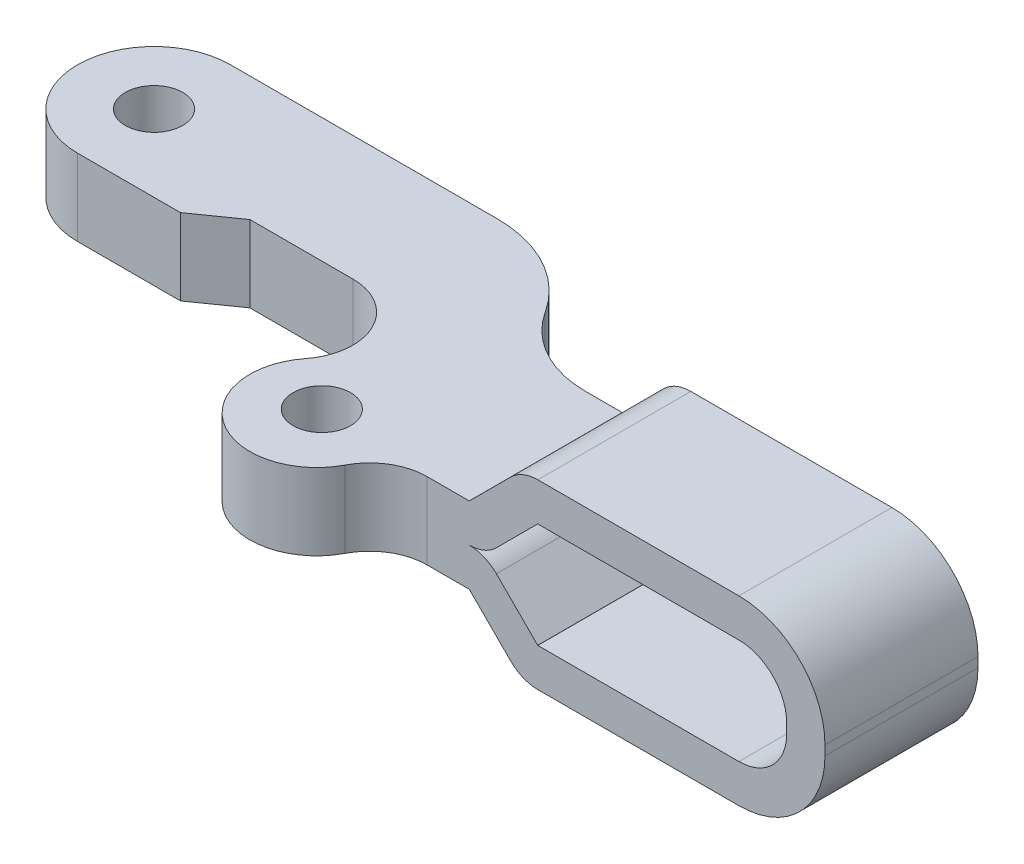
ISO-10303-21;
HEADER;
FILE_DESCRIPTION(('STEP AP214'),'2;1');
FILE_NAME('part.step','',(''),(''),'','','');
FILE_SCHEMA(('AUTOMOTIVE_DESIGN { 1 0 10303 214 1 1 1 1 }'));
ENDSEC;
DATA;
#1=APPLICATION_CONTEXT('core data for automotive mechanical design processes');
#2=APPLICATION_PROTOCOL_DEFINITION('international standard','automotive_design',2000,#1);
#3=PRODUCT_CONTEXT('',#1,'mechanical');
#4=PRODUCT('Part','Part','',(#3));
#5=PRODUCT_RELATED_PRODUCT_CATEGORY('part','',(#4));
#6=PRODUCT_DEFINITION_FORMATION('','',#4);
#7=PRODUCT_DEFINITION_CONTEXT('part definition',#1,'design');
#8=PRODUCT_DEFINITION('design','',#6,#7);
#9=PRODUCT_DEFINITION_SHAPE('','',#8);
#10=(LENGTH_UNIT() NAMED_UNIT(*) SI_UNIT(.MILLI.,.METRE.));
#11=(NAMED_UNIT(*) PLANE_ANGLE_UNIT() SI_UNIT($,.RADIAN.));
#12=(NAMED_UNIT(*) SI_UNIT($,.STERADIAN.) SOLID_ANGLE_UNIT());
#13=UNCERTAINTY_MEASURE_WITH_UNIT(LENGTH_MEASURE(1.E-05),#10,'distance_accuracy_value','');
#14=(GEOMETRIC_REPRESENTATION_CONTEXT(3) GLOBAL_UNCERTAINTY_ASSIGNED_CONTEXT((#13)) GLOBAL_UNIT_ASSIGNED_CONTEXT((#10,
#11,#12)) REPRESENTATION_CONTEXT('',''));
#15=CARTESIAN_POINT('',(0.,0.,0.));
#16=DIRECTION('',(0.,0.,1.));
#17=DIRECTION('',(1.,0.,0.));
#18=AXIS2_PLACEMENT_3D('',#15,#16,#17);
#19=CARTESIAN_POINT('',(45.7788506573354,2.,1.50570552));
#20=DIRECTION('',(0.,0.,1.));
#21=DIRECTION('',(0.,1.,0.));
#22=AXIS2_PLACEMENT_3D('',#19,#20,#21);
#23=PLANE('',#22);
#24=DIRECTION('',(0.,1.,0.));
#25=VECTOR('',#24,1.);
#26=CARTESIAN_POINT('',(44.5788506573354,1.09995593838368,1.50570552));
#27=LINE('',#26,#25);
#28=CARTESIAN_POINT('',(44.5788506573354,-0.25,1.50570552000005));
#29=VERTEX_POINT('',#28);
#30=CARTESIAN_POINT('',(44.5788506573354,0.24999999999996,1.50570552));
#31=VERTEX_POINT('',#30);
#32=EDGE_CURVE('E330',#29,#31,#27,.T.);
#33=ORIENTED_EDGE('',*,*,#32,.F.);
#34=CARTESIAN_POINT('',(40.0788506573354,-0.25000000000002,1.50570552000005));
#35=DIRECTION('',(0.,0.,-1.));
#36=DIRECTION('',(-1.,0.,0.));
#37=AXIS2_PLACEMENT_3D('',#34,#35,#36);
#38=CIRCLE('',#37,4.5);
#39=CARTESIAN_POINT('',(40.0788506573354,-4.75,1.50570552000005));
#40=VERTEX_POINT('',#39);
#41=EDGE_CURVE('E449',#40,#29,#38,.F.);
#42=ORIENTED_EDGE('',*,*,#41,.F.);
#43=DIRECTION('',(-1.,0.,0.));
#44=VECTOR('',#43,1.);
#45=CARTESIAN_POINT('',(11.8413847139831,-4.75,1.50570552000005));
#46=LINE('',#45,#44);
#47=CARTESIAN_POINT('',(29.5689359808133,-4.75,1.50570552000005));
#48=VERTEX_POINT('',#47);
#49=EDGE_CURVE('E442',#40,#48,#46,.T.);
#50=ORIENTED_EDGE('',*,*,#49,.T.);
#51=CARTESIAN_POINT('',(29.5689359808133,-2.74,1.50570552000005));
#52=DIRECTION('',(0.,0.,-1.));
#53=DIRECTION('',(-1.,0.,0.));
#54=AXIS2_PLACEMENT_3D('',#51,#52,#53);
#55=CIRCLE('',#54,2.01);
#56=CARTESIAN_POINT('',(28.1476513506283,-4.16128463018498,1.50570552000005));
#57=VERTEX_POINT('',#56);
#58=EDGE_CURVE('E438',#57,#48,#55,.F.);
#59=ORIENTED_EDGE('',*,*,#58,.F.);
#60=DIRECTION('',(-0.707106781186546,0.707106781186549,0.));
#61=VECTOR('',#60,1.);
#62=CARTESIAN_POINT('',(16.1732936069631,7.81307311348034,1.50570552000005));
#63=LINE('',#62,#61);
#64=CARTESIAN_POINT('',(25.9892956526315,-2.00292893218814,1.50570552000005));
#65=VERTEX_POINT('',#64);
#66=EDGE_CURVE('E423',#57,#65,#63,.T.);
#67=ORIENTED_EDGE('',*,*,#66,.T.);
#68=CARTESIAN_POINT('',(25.9822245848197,-2.01,1.50570552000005));
#69=DIRECTION('',(0.,0.,-1.));
#70=DIRECTION('',(0.,-1.,0.));
#71=AXIS2_PLACEMENT_3D('',#68,#69,#70);
#72=CIRCLE('',#71,0.00999999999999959);
#73=CARTESIAN_POINT('',(25.9822245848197,-2.,1.50570552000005));
#74=VERTEX_POINT('',#73);
#75=EDGE_CURVE('E445',#65,#74,#72,.F.);
#76=ORIENTED_EDGE('',*,*,#75,.T.);
#77=DIRECTION('',(-1.,0.,0.));
#78=VECTOR('',#77,1.);
#79=CARTESIAN_POINT('',(12.8935535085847,-2.,1.50570552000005));
#80=LINE('',#79,#78);
#81=CARTESIAN_POINT('',(24.0552058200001,-2.,1.50570552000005));
#82=VERTEX_POINT('',#81);
#83=EDGE_CURVE('E405',#74,#82,#80,.T.);
#84=ORIENTED_EDGE('',*,*,#83,.T.);
#85=DIRECTION('',(0.,1.,0.));
#86=VECTOR('',#85,1.);
#87=CARTESIAN_POINT('',(24.05520582,2.,1.50570552));
#88=LINE('',#87,#86);
#89=CARTESIAN_POINT('',(24.05520582,2.,1.50570552));
#90=VERTEX_POINT('',#89);
#91=EDGE_CURVE('E545',#90,#82,#88,.F.);
#92=ORIENTED_EDGE('',*,*,#91,.F.);
#93=DIRECTION('',(-1.,0.,0.));
#94=VECTOR('',#93,1.);
#95=CARTESIAN_POINT('',(45.7788506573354,2.,1.50570552));
#96=LINE('',#95,#94);
#97=CARTESIAN_POINT('',(25.9822245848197,2.,1.50570552));
#98=VERTEX_POINT('',#97);
#99=EDGE_CURVE('E27',#98,#90,#96,.T.);
#100=ORIENTED_EDGE('',*,*,#99,.F.);
#101=CARTESIAN_POINT('',(25.9822245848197,2.01,1.50570552));
#102=DIRECTION('',(0.,0.,-1.));
#103=DIRECTION('',(-1.,0.,0.));
#104=AXIS2_PLACEMENT_3D('',#101,#102,#103);
#105=CIRCLE('',#104,0.00999999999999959);
#106=CARTESIAN_POINT('',(25.9892956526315,2.0029289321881,1.50570552));
#107=VERTEX_POINT('',#106);
#108=EDGE_CURVE('E363',#107,#98,#105,.T.);
#109=ORIENTED_EDGE('',*,*,#108,.F.);
#110=DIRECTION('',(-0.707106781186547,-0.707106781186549,0.));
#111=VECTOR('',#110,1.);
#112=CARTESIAN_POINT('',(28.1476513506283,4.16128463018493,1.50570552));
#113=LINE('',#112,#111);
#114=CARTESIAN_POINT('',(28.1476513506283,4.16128463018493,1.50570552));
#115=VERTEX_POINT('',#114);
#116=EDGE_CURVE('E271',#115,#107,#113,.T.);
#117=ORIENTED_EDGE('',*,*,#116,.F.);
#118=CARTESIAN_POINT('',(29.5689359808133,2.74,1.50570552));
#119=DIRECTION('',(0.,0.,-1.));
#120=DIRECTION('',(-1.,0.,0.));
#121=AXIS2_PLACEMENT_3D('',#118,#119,#120);
#122=CIRCLE('',#121,2.01);
#123=CARTESIAN_POINT('',(29.5689359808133,4.75,1.50570552));
#124=VERTEX_POINT('',#123);
#125=EDGE_CURVE('E293',#115,#124,#122,.T.);
#126=ORIENTED_EDGE('',*,*,#125,.T.);
#127=DIRECTION('',(1.,0.,0.));
#128=VECTOR('',#127,1.);
#129=CARTESIAN_POINT('',(44.7266818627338,4.75,1.50570552));
#130=LINE('',#129,#128);
#131=CARTESIAN_POINT('',(40.0788506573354,4.75,1.50570552));
#132=VERTEX_POINT('',#131);
#133=EDGE_CURVE('E306',#132,#124,#130,.F.);
#134=ORIENTED_EDGE('',*,*,#133,.F.);
#135=CARTESIAN_POINT('',(40.0788506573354,0.24999999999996,1.50570552));
#136=DIRECTION('',(0.,0.,-1.));
#137=DIRECTION('',(-1.,0.,0.));
#138=AXIS2_PLACEMENT_3D('',#135,#136,#137);
#139=CIRCLE('',#138,4.5);
#140=EDGE_CURVE('E318',#132,#31,#139,.T.);
#141=ORIENTED_EDGE('',*,*,#140,.T.);
#142=EDGE_LOOP('',(#33,#42,#50,#59,#67,#76,#84,#92,#100,#109,#117,#126,#134,#141));
#143=FACE_BOUND('',#142,.T.);
#144=CARTESIAN_POINT('',(40.0788506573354,-0.25000000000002,1.50570552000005));
#145=DIRECTION('',(0.,0.,-1.));
#146=DIRECTION('',(-1.,0.,0.));
#147=AXIS2_PLACEMENT_3D('',#144,#145,#146);
#148=CIRCLE('',#147,2.5);
#149=CARTESIAN_POINT('',(42.5788506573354,-0.25,1.50570552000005));
#150=VERTEX_POINT('',#149);
#151=CARTESIAN_POINT('',(40.0788506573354,-2.75,1.50570552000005));
#152=VERTEX_POINT('',#151);
#153=EDGE_CURVE('E467',#150,#152,#148,.T.);
#154=ORIENTED_EDGE('',*,*,#153,.F.);
#155=DIRECTION('',(0.,1.,0.));
#156=VECTOR('',#155,1.);
#157=CARTESIAN_POINT('',(42.5788506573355,33.9852530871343,1.50570552));
#158=LINE('',#157,#156);
#159=CARTESIAN_POINT('',(42.5788506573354,0.24999999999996,1.50570552));
#160=VERTEX_POINT('',#159);
#161=EDGE_CURVE('E322',#150,#160,#158,.T.);
#162=ORIENTED_EDGE('',*,*,#161,.T.);
#163=CARTESIAN_POINT('',(40.0788506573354,0.24999999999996,1.50570552));
#164=DIRECTION('',(0.,0.,-1.));
#165=DIRECTION('',(-1.,0.,0.));
#166=AXIS2_PLACEMENT_3D('',#163,#164,#165);
#167=CIRCLE('',#166,2.5);
#168=CARTESIAN_POINT('',(40.0788506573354,2.75,1.50570552));
#169=VERTEX_POINT('',#168);
#170=EDGE_CURVE('E309',#160,#169,#167,.F.);
#171=ORIENTED_EDGE('',*,*,#170,.T.);
#172=DIRECTION('',(-1.,0.,0.));
#173=VECTOR('',#172,1.);
#174=CARTESIAN_POINT('',(11.8413847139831,2.75,1.50570552));
#175=LINE('',#174,#173);
#176=CARTESIAN_POINT('',(29.5689359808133,2.75,1.50570552));
#177=VERTEX_POINT('',#176);
#178=EDGE_CURVE('E296',#169,#177,#175,.T.);
#179=ORIENTED_EDGE('',*,*,#178,.T.);
#180=CARTESIAN_POINT('',(29.5689359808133,2.74,1.50570552));
#181=DIRECTION('',(0.,0.,-1.));
#182=DIRECTION('',(0.,-1.,0.));
#183=AXIS2_PLACEMENT_3D('',#180,#181,#182);
#184=CIRCLE('',#183,0.00999999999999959);
#185=CARTESIAN_POINT('',(29.5618649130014,2.74707106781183,1.50570552));
#186=VERTEX_POINT('',#185);
#187=EDGE_CURVE('E275',#177,#186,#184,.F.);
#188=ORIENTED_EDGE('',*,*,#187,.T.);
#189=DIRECTION('',(-0.707106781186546,-0.707106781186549,0.));
#190=VECTOR('',#189,1.);
#191=CARTESIAN_POINT('',(17.5875071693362,-9.22728667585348,1.50570552));
#192=LINE('',#191,#190);
#193=CARTESIAN_POINT('',(27.4035092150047,0.58871536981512,1.50570552));
#194=VERTEX_POINT('',#193);
#195=EDGE_CURVE('E282',#186,#194,#192,.T.);
#196=ORIENTED_EDGE('',*,*,#195,.T.);
#197=CARTESIAN_POINT('',(25.9822245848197,2.01,1.50570552));
#198=DIRECTION('',(0.,0.,-1.));
#199=DIRECTION('',(-1.,0.,0.));
#200=AXIS2_PLACEMENT_3D('',#197,#198,#199);
#201=CIRCLE('',#200,2.01);
#202=CARTESIAN_POINT('',(25.9822245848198,0.,1.50570552));
#203=VERTEX_POINT('',#202);
#204=EDGE_CURVE('E343',#203,#194,#201,.F.);
#205=ORIENTED_EDGE('',*,*,#204,.F.);
#206=CARTESIAN_POINT('',(25.9822245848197,-2.01,1.50570552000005));
#207=DIRECTION('',(0.,0.,-1.));
#208=DIRECTION('',(-1.,0.,0.));
#209=AXIS2_PLACEMENT_3D('',#206,#207,#208);
#210=CIRCLE('',#209,2.01);
#211=CARTESIAN_POINT('',(27.4035092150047,-0.588715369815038,1.50570552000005));
#212=VERTEX_POINT('',#211);
#213=EDGE_CURVE('E484',#203,#212,#210,.T.);
#214=ORIENTED_EDGE('',*,*,#213,.T.);
#215=DIRECTION('',(-0.707106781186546,0.70710678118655,0.));
#216=VECTOR('',#215,1.);
#217=CARTESIAN_POINT('',(29.5618649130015,-2.74707106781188,1.50570552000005));
#218=LINE('',#217,#216);
#219=CARTESIAN_POINT('',(29.5618649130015,-2.74707106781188,1.50570552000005));
#220=VERTEX_POINT('',#219);
#221=EDGE_CURVE('E417',#220,#212,#218,.T.);
#222=ORIENTED_EDGE('',*,*,#221,.F.);
#223=CARTESIAN_POINT('',(29.5689359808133,-2.74,1.50570552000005));
#224=DIRECTION('',(0.,0.,-1.));
#225=DIRECTION('',(-1.,0.,0.));
#226=AXIS2_PLACEMENT_3D('',#223,#224,#225);
#227=CIRCLE('',#226,0.00999999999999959);
#228=CARTESIAN_POINT('',(29.5689359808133,-2.75,1.50570552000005));
#229=VERTEX_POINT('',#228);
#230=EDGE_CURVE('E492',#229,#220,#227,.T.);
#231=ORIENTED_EDGE('',*,*,#230,.F.);
#232=DIRECTION('',(1.,0.,0.));
#233=VECTOR('',#232,1.);
#234=CARTESIAN_POINT('',(44.7266818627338,-2.75,1.50570552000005));
#235=LINE('',#234,#233);
#236=EDGE_CURVE('E450',#152,#229,#235,.F.);
#237=ORIENTED_EDGE('',*,*,#236,.F.);
#238=EDGE_LOOP('',(#154,#162,#171,#179,#188,#196,#205,#214,#222,#231,#237));
#239=FACE_BOUND('',#238,.T.);
#240=ADVANCED_FACE('F17',(#143,#239),#23,.F.);
#241=CARTESIAN_POINT('',(24.05520582,2.,-3.99429447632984));
#242=DIRECTION('',(0.,-1.,0.));
#243=DIRECTION('',(1.,0.,0.));
#244=AXIS2_PLACEMENT_3D('',#241,#242,#243);
#245=CYLINDRICAL_SURFACE('',#244,5.49999999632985);
#246=DIRECTION('',(0.,-1.,0.));
#247=VECTOR('',#246,1.);
#248=CARTESIAN_POINT('',(19.4302582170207,2.,-1.01774284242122));
#249=LINE('',#248,#247);
#250=CARTESIAN_POINT('',(19.4302582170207,2.,-1.01774284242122));
#251=VERTEX_POINT('',#250);
#252=CARTESIAN_POINT('',(19.4302582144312,-2.,-1.01774284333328));
#253=VERTEX_POINT('',#252);
#254=EDGE_CURVE('E358',#251,#253,#249,.T.);
#255=ORIENTED_EDGE('',*,*,#254,.F.);
#256=CARTESIAN_POINT('',(24.05520582,2.,-3.99429447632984));
#257=DIRECTION('',(0.,-1.,0.));
#258=DIRECTION('',(1.,0.,0.));
#259=AXIS2_PLACEMENT_3D('',#256,#257,#258);
#260=CIRCLE('',#259,5.49999999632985);
#261=EDGE_CURVE('E359',#90,#251,#260,.T.);
#262=ORIENTED_EDGE('',*,*,#261,.F.);
#263=ORIENTED_EDGE('',*,*,#91,.T.);
#264=CARTESIAN_POINT('',(24.0552058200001,-2.,-3.99429447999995));
#265=DIRECTION('',(0.,-1.,0.));
#266=DIRECTION('',(1.,0.,0.));
#267=AXIS2_PLACEMENT_3D('',#264,#265,#266);
#268=CIRCLE('',#267,5.5);
#269=EDGE_CURVE('E408',#82,#253,#268,.T.);
#270=ORIENTED_EDGE('',*,*,#269,.T.);
#271=EDGE_LOOP('',(#255,#262,#263,#270));
#272=FACE_BOUND('',#271,.T.);
#273=ADVANCED_FACE('F575',(#272),#245,.F.);
#274=CARTESIAN_POINT('',(13.9644110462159,2.,2.5));
#275=DIRECTION('',(0.,-1.,0.));
#276=DIRECTION('',(1.,0.,0.));
#277=AXIS2_PLACEMENT_3D('',#274,#275,#276);
#278=CYLINDRICAL_SURFACE('',#277,6.5);
#279=CARTESIAN_POINT('',(13.9644110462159,2.,2.5));
#280=DIRECTION('',(0.,-1.,0.));
#281=DIRECTION('',(1.,0.,0.));
#282=AXIS2_PLACEMENT_3D('',#279,#280,#281);
#283=CIRCLE('',#282,6.5);
#284=CARTESIAN_POINT('',(13.9644110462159,2.,-4.));
#285=VERTEX_POINT('',#284);
#286=EDGE_CURVE('E356',#285,#251,#283,.T.);
#287=ORIENTED_EDGE('',*,*,#286,.T.);
#288=ORIENTED_EDGE('',*,*,#254,.T.);
#289=CARTESIAN_POINT('',(13.9644110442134,-2.,2.5000000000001));
#290=DIRECTION('',(0.,-1.,0.));
#291=DIRECTION('',(1.,0.,0.));
#292=AXIS2_PLACEMENT_3D('',#289,#290,#291);
#293=CIRCLE('',#292,6.5);
#294=CARTESIAN_POINT('',(13.9644110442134,-2.,-3.99999999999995));
#295=VERTEX_POINT('',#294);
#296=EDGE_CURVE('E404',#253,#295,#293,.F.);
#297=ORIENTED_EDGE('',*,*,#296,.T.);
#298=DIRECTION('',(0.,1.,0.));
#299=VECTOR('',#298,1.);
#300=CARTESIAN_POINT('',(13.9644110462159,2.,-4.));
#301=LINE('',#300,#299);
#302=EDGE_CURVE('E270',#295,#285,#301,.T.);
#303=ORIENTED_EDGE('',*,*,#302,.T.);
#304=EDGE_LOOP('',(#287,#288,#297,#303));
#305=FACE_BOUND('',#304,.T.);
#306=ADVANCED_FACE('F567',(#305),#278,.T.);
#307=CARTESIAN_POINT('',(0.,2.,-4.));
#308=DIRECTION('',(0.,0.,1.));
#309=DIRECTION('',(1.,0.,0.));
#310=AXIS2_PLACEMENT_3D('',#307,#308,#309);
#311=PLANE('',#310);
#312=DIRECTION('',(0.,-1.,0.));
#313=VECTOR('',#312,1.);
#314=CARTESIAN_POINT('',(0.,2.,-4.));
#315=LINE('',#314,#313);
#316=CARTESIAN_POINT('',(0.,2.,-4.));
#317=VERTEX_POINT('',#316);
#318=CARTESIAN_POINT('',(0.,-2.,-3.99999999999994));
#319=VERTEX_POINT('',#318);
#320=EDGE_CURVE('E355',#317,#319,#315,.T.);
#321=ORIENTED_EDGE('',*,*,#320,.F.);
#322=DIRECTION('',(1.,0.,0.));
#323=VECTOR('',#322,1.);
#324=CARTESIAN_POINT('',(0.,2.,-4.));
#325=LINE('',#324,#323);
#326=EDGE_CURVE('E266',#285,#317,#325,.F.);
#327=ORIENTED_EDGE('',*,*,#326,.F.);
#328=ORIENTED_EDGE('',*,*,#302,.F.);
#329=DIRECTION('',(-1.,0.,0.));
#330=VECTOR('',#329,1.);
#331=CARTESIAN_POINT('',(12.8935535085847,-2.,-3.99999999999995));
#332=LINE('',#331,#330);
#333=EDGE_CURVE('E401',#295,#319,#332,.T.);
#334=ORIENTED_EDGE('',*,*,#333,.T.);
#335=EDGE_LOOP('',(#321,#327,#328,#334));
#336=FACE_BOUND('',#335,.T.);
#337=ADVANCED_FACE('F584',(#336),#311,.F.);
#338=CARTESIAN_POINT('',(0.,2.,0.));
#339=DIRECTION('',(0.,-1.,0.));
#340=DIRECTION('',(1.,0.,0.));
#341=AXIS2_PLACEMENT_3D('',#338,#339,#340);
#342=CYLINDRICAL_SURFACE('',#341,4.);
#343=CARTESIAN_POINT('',(0.,2.,0.));
#344=DIRECTION('',(0.,-1.,0.));
#345=DIRECTION('',(1.,0.,0.));
#346=AXIS2_PLACEMENT_3D('',#343,#344,#345);
#347=CIRCLE('',#346,4.);
#348=CARTESIAN_POINT('',(0.,2.,4.));
#349=VERTEX_POINT('',#348);
#350=EDGE_CURVE('E269',#349,#317,#347,.T.);
#351=ORIENTED_EDGE('',*,*,#350,.T.);
#352=ORIENTED_EDGE('',*,*,#320,.T.);
#353=CARTESIAN_POINT('',(0.,-2.,0.));
#354=DIRECTION('',(0.,-1.,0.));
#355=DIRECTION('',(1.,0.,0.));
#356=AXIS2_PLACEMENT_3D('',#353,#354,#355);
#357=CIRCLE('',#356,4.);
#358=CARTESIAN_POINT('',(0.,-2.,4.00000000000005));
#359=VERTEX_POINT('',#358);
#360=EDGE_CURVE('E400',#319,#359,#357,.F.);
#361=ORIENTED_EDGE('',*,*,#360,.T.);
#362=DIRECTION('',(0.,1.,0.));
#363=VECTOR('',#362,1.);
#364=CARTESIAN_POINT('',(0.,2.,4.));
#365=LINE('',#364,#363);
#366=EDGE_CURVE('E265',#359,#349,#365,.T.);
#367=ORIENTED_EDGE('',*,*,#366,.T.);
#368=EDGE_LOOP('',(#351,#352,#361,#367));
#369=FACE_BOUND('',#368,.T.);
#370=ADVANCED_FACE('F876',(#369),#342,.T.);
#371=CARTESIAN_POINT('',(12.8935535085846,2.,2.5));
#372=DIRECTION('',(0.,0.,-1.));
#373=DIRECTION('',(-1.,0.,0.));
#374=AXIS2_PLACEMENT_3D('',#371,#372,#373);
#375=PLANE('',#374);
#376=DIRECTION('',(0.,-1.,0.));
#377=VECTOR('',#376,1.);
#378=CARTESIAN_POINT('',(12.8935535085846,2.,2.5));
#379=LINE('',#378,#377);
#380=CARTESIAN_POINT('',(12.8935535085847,-2.,2.50000000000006));
#381=VERTEX_POINT('',#380);
#382=CARTESIAN_POINT('',(12.8935535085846,2.,2.5));
#383=VERTEX_POINT('',#382);
#384=EDGE_CURVE('E256',#381,#383,#379,.F.);
#385=ORIENTED_EDGE('',*,*,#384,.T.);
#386=DIRECTION('',(-1.,0.,0.));
#387=VECTOR('',#386,1.);
#388=CARTESIAN_POINT('',(12.8935535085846,2.,2.5));
#389=LINE('',#388,#387);
#390=CARTESIAN_POINT('',(7.51152342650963,2.,2.5));
#391=VERTEX_POINT('',#390);
#392=EDGE_CURVE('E243',#391,#383,#389,.F.);
#393=ORIENTED_EDGE('',*,*,#392,.F.);
#394=DIRECTION('',(0.,-1.,0.));
#395=VECTOR('',#394,1.);
#396=CARTESIAN_POINT('',(7.51152342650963,2.,2.5));
#397=LINE('',#396,#395);
#398=CARTESIAN_POINT('',(7.51152342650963,-2.,2.5));
#399=VERTEX_POINT('',#398);
#400=EDGE_CURVE('E247',#391,#399,#397,.T.);
#401=ORIENTED_EDGE('',*,*,#400,.T.);
#402=DIRECTION('',(-1.,0.,0.));
#403=VECTOR('',#402,1.);
#404=CARTESIAN_POINT('',(12.8935535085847,-2.,2.50000000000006));
#405=LINE('',#404,#403);
#406=EDGE_CURVE('E393',#399,#381,#405,.F.);
#407=ORIENTED_EDGE('',*,*,#406,.T.);
#408=EDGE_LOOP('',(#385,#393,#401,#407));
#409=FACE_BOUND('',#408,.T.);
#410=ADVANCED_FACE('F255',(#409),#375,.F.);
#411=CARTESIAN_POINT('',(12.8935535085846,2.,5.5));
#412=DIRECTION('',(0.,-1.,0.));
#413=DIRECTION('',(1.,0.,0.));
#414=AXIS2_PLACEMENT_3D('',#411,#412,#413);
#415=CYLINDRICAL_SURFACE('',#414,3.);
#416=CARTESIAN_POINT('',(12.8935535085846,2.,5.5));
#417=DIRECTION('',(0.,-1.,0.));
#418=DIRECTION('',(1.,0.,0.));
#419=AXIS2_PLACEMENT_3D('',#416,#417,#418);
#420=CIRCLE('',#419,3.);
#421=CARTESIAN_POINT('',(15.2561762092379,2.,7.34878716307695));
#422=VERTEX_POINT('',#421);
#423=EDGE_CURVE('E258',#383,#422,#420,.T.);
#424=ORIENTED_EDGE('',*,*,#423,.F.);
#425=ORIENTED_EDGE('',*,*,#384,.F.);
#426=CARTESIAN_POINT('',(12.8935535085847,-2.,5.5));
#427=DIRECTION('',(0.,-1.,0.));
#428=DIRECTION('',(1.,0.,0.));
#429=AXIS2_PLACEMENT_3D('',#426,#427,#428);
#430=CIRCLE('',#429,3.);
#431=CARTESIAN_POINT('',(15.256176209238,-2.,7.348787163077));
#432=VERTEX_POINT('',#431);
#433=EDGE_CURVE('E395',#381,#432,#430,.T.);
#434=ORIENTED_EDGE('',*,*,#433,.T.);
#435=DIRECTION('',(0.,-1.,0.));
#436=VECTOR('',#435,1.);
#437=CARTESIAN_POINT('',(15.2561762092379,2.,7.34878716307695));
#438=LINE('',#437,#436);
#439=EDGE_CURVE('E352',#422,#432,#438,.T.);
#440=ORIENTED_EDGE('',*,*,#439,.F.);
#441=EDGE_LOOP('',(#424,#425,#434,#440));
#442=FACE_BOUND('',#441,.T.);
#443=ADVANCED_FACE('F857',(#442),#415,.F.);
#444=CARTESIAN_POINT('',(18.01256936,2.,9.50570552));
#445=DIRECTION('',(0.,-1.,0.));
#446=DIRECTION('',(1.,0.,0.));
#447=AXIS2_PLACEMENT_3D('',#444,#445,#446);
#448=CYLINDRICAL_SURFACE('',#447,3.5);
#449=CARTESIAN_POINT('',(18.01256936,2.,9.50570552));
#450=DIRECTION('',(0.,-1.,0.));
#451=DIRECTION('',(1.,0.,0.));
#452=AXIS2_PLACEMENT_3D('',#449,#450,#451);
#453=CIRCLE('',#452,3.5);
#454=CARTESIAN_POINT('',(21.1174900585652,2.,11.1210901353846));
#455=VERTEX_POINT('',#454);
#456=EDGE_CURVE('E350',#455,#422,#453,.T.);
#457=ORIENTED_EDGE('',*,*,#456,.T.);
#458=ORIENTED_EDGE('',*,*,#439,.T.);
#459=CARTESIAN_POINT('',(18.0125693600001,-2.,9.50570552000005));
#460=DIRECTION('',(0.,-1.,0.));
#461=DIRECTION('',(1.,0.,0.));
#462=AXIS2_PLACEMENT_3D('',#459,#460,#461);
#463=CIRCLE('',#462,3.5);
#464=CARTESIAN_POINT('',(21.1174900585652,-2.,11.1210901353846));
#465=VERTEX_POINT('',#464);
#466=EDGE_CURVE('E472',#432,#465,#463,.F.);
#467=ORIENTED_EDGE('',*,*,#466,.T.);
#468=DIRECTION('',(0.,-1.,0.));
#469=VECTOR('',#468,1.);
#470=CARTESIAN_POINT('',(21.1174900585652,2.,11.1210901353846));
#471=LINE('',#470,#469);
#472=EDGE_CURVE('E349',#465,#455,#471,.F.);
#473=ORIENTED_EDGE('',*,*,#472,.T.);
#474=EDGE_LOOP('',(#457,#458,#467,#473));
#475=FACE_BOUND('',#474,.T.);
#476=ADVANCED_FACE('F848',(#475),#448,.T.);
#477=CARTESIAN_POINT('',(40.0788506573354,0.24999999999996,15.4165916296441));
#478=DIRECTION('',(0.,0.,-1.));
#479=DIRECTION('',(-1.,0.,0.));
#480=AXIS2_PLACEMENT_3D('',#477,#478,#479);
#481=CYLINDRICAL_SURFACE('',#480,2.5);
#482=DIRECTION('',(0.,0.,-1.));
#483=VECTOR('',#482,1.);
#484=CARTESIAN_POINT('',(42.5788506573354,0.249999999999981,15.4165916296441));
#485=LINE('',#484,#483);
#486=CARTESIAN_POINT('',(42.5788506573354,0.249999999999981,9.50570552));
#487=VERTEX_POINT('',#486);
#488=EDGE_CURVE('E319',#487,#160,#485,.T.);
#489=ORIENTED_EDGE('',*,*,#488,.F.);
#490=CARTESIAN_POINT('',(40.0788506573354,0.24999999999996,9.50570552));
#491=DIRECTION('',(0.,0.,-1.));
#492=DIRECTION('',(-1.,0.,0.));
#493=AXIS2_PLACEMENT_3D('',#490,#491,#492);
#494=CIRCLE('',#493,2.5);
#495=CARTESIAN_POINT('',(40.0788506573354,2.75,9.50570552));
#496=VERTEX_POINT('',#495);
#497=EDGE_CURVE('E315',#496,#487,#494,.T.);
#498=ORIENTED_EDGE('',*,*,#497,.F.);
#499=DIRECTION('',(0.,0.,1.));
#500=VECTOR('',#499,1.);
#501=CARTESIAN_POINT('',(40.0788506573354,2.75,5.5));
#502=LINE('',#501,#500);
#503=EDGE_CURVE('E302',#496,#169,#502,.F.);
#504=ORIENTED_EDGE('',*,*,#503,.T.);
#505=ORIENTED_EDGE('',*,*,#170,.F.);
#506=EDGE_LOOP('',(#489,#498,#504,#505));
#507=FACE_BOUND('',#506,.T.);
#508=ADVANCED_FACE('F524',(#507),#481,.F.);
#509=CARTESIAN_POINT('',(11.8413847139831,2.75,5.5));
#510=DIRECTION('',(0.,1.,0.));
#511=DIRECTION('',(-1.,0.,0.));
#512=AXIS2_PLACEMENT_3D('',#509,#510,#511);
#513=PLANE('',#512);
#514=DIRECTION('',(-1.,0.,0.));
#515=VECTOR('',#514,1.);
#516=CARTESIAN_POINT('',(11.8413847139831,2.75,9.50570552));
#517=LINE('',#516,#515);
#518=CARTESIAN_POINT('',(29.5689359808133,2.75,9.50570552));
#519=VERTEX_POINT('',#518);
#520=EDGE_CURVE('E298',#519,#496,#517,.F.);
#521=ORIENTED_EDGE('',*,*,#520,.F.);
#522=DIRECTION('',(0.,0.,-1.));
#523=VECTOR('',#522,1.);
#524=CARTESIAN_POINT('',(29.5689359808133,2.75,13.979326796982));
#525=LINE('',#524,#523);
#526=EDGE_CURVE('E290',#519,#177,#525,.T.);
#527=ORIENTED_EDGE('',*,*,#526,.T.);
#528=ORIENTED_EDGE('',*,*,#178,.F.);
#529=ORIENTED_EDGE('',*,*,#503,.F.);
#530=EDGE_LOOP('',(#521,#527,#528,#529));
#531=FACE_BOUND('',#530,.T.);
#532=ADVANCED_FACE('F535',(#531),#513,.F.);
#533=CARTESIAN_POINT('',(29.5689359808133,2.74,13.979326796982));
#534=DIRECTION('',(0.,0.,-1.));
#535=DIRECTION('',(-1.,0.,0.));
#536=AXIS2_PLACEMENT_3D('',#533,#534,#535);
#537=CYLINDRICAL_SURFACE('',#536,0.00999999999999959);
#538=ORIENTED_EDGE('',*,*,#187,.F.);
#539=ORIENTED_EDGE('',*,*,#526,.F.);
#540=CARTESIAN_POINT('',(29.5689359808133,2.74,9.50570552));
#541=DIRECTION('',(0.,0.,1.));
#542=DIRECTION('',(0.,1.,0.));
#543=AXIS2_PLACEMENT_3D('',#540,#541,#542);
#544=CIRCLE('',#543,0.00999999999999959);
#545=CARTESIAN_POINT('',(29.5618649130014,2.74707106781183,9.50570552));
#546=VERTEX_POINT('',#545);
#547=EDGE_CURVE('E305',#546,#519,#544,.F.);
#548=ORIENTED_EDGE('',*,*,#547,.F.);
#549=DIRECTION('',(0.,0.,1.));
#550=VECTOR('',#549,1.);
#551=CARTESIAN_POINT('',(29.5618649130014,2.74707106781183,5.5));
#552=LINE('',#551,#550);
#553=EDGE_CURVE('E279',#546,#186,#552,.F.);
#554=ORIENTED_EDGE('',*,*,#553,.T.);
#555=EDGE_LOOP('',(#538,#539,#548,#554));
#556=FACE_BOUND('',#555,.T.);
#557=ADVANCED_FACE('F532',(#556),#537,.F.);
#558=CARTESIAN_POINT('',(17.5875071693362,-9.22728667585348,5.5));
#559=DIRECTION('',(-0.707106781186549,0.707106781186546,0.));
#560=DIRECTION('',(-0.707106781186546,-0.707106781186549,0.));
#561=AXIS2_PLACEMENT_3D('',#558,#559,#560);
#562=PLANE('',#561);
#563=ORIENTED_EDGE('',*,*,#553,.F.);
#564=DIRECTION('',(-0.707106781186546,-0.707106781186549,0.));
#565=VECTOR('',#564,1.);
#566=CARTESIAN_POINT('',(17.5875071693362,-9.22728667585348,9.50570552));
#567=LINE('',#566,#565);
#568=CARTESIAN_POINT('',(27.4035092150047,0.58871536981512,9.50570552));
#569=VERTEX_POINT('',#568);
#570=EDGE_CURVE('E283',#569,#546,#567,.F.);
#571=ORIENTED_EDGE('',*,*,#570,.F.);
#572=DIRECTION('',(0.,0.,-1.));
#573=VECTOR('',#572,1.);
#574=CARTESIAN_POINT('',(27.4035092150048,0.58871536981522,13.7899827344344));
#575=LINE('',#574,#573);
#576=EDGE_CURVE('E345',#194,#569,#575,.F.);
#577=ORIENTED_EDGE('',*,*,#576,.F.);
#578=ORIENTED_EDGE('',*,*,#195,.F.);
#579=EDGE_LOOP('',(#563,#571,#577,#578));
#580=FACE_BOUND('',#579,.T.);
#581=ADVANCED_FACE('F538',(#580),#562,.F.);
#582=CARTESIAN_POINT('',(25.9822245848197,2.01,13.7899827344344));
#583=DIRECTION('',(0.,0.,-1.));
#584=DIRECTION('',(-1.,0.,0.));
#585=AXIS2_PLACEMENT_3D('',#582,#583,#584);
#586=CYLINDRICAL_SURFACE('',#585,2.01);
#587=ORIENTED_EDGE('',*,*,#576,.T.);
#588=CARTESIAN_POINT('',(25.9822245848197,2.01,9.50570552));
#589=DIRECTION('',(0.,0.,-1.));
#590=DIRECTION('',(-1.,0.,0.));
#591=AXIS2_PLACEMENT_3D('',#588,#589,#590);
#592=CIRCLE('',#591,2.01);
#593=CARTESIAN_POINT('',(25.9822245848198,0.,9.50570552));
#594=VERTEX_POINT('',#593);
#595=EDGE_CURVE('E286',#569,#594,#592,.T.);
#596=ORIENTED_EDGE('',*,*,#595,.T.);
#597=DIRECTION('',(0.,0.,1.));
#598=VECTOR('',#597,1.);
#599=CARTESIAN_POINT('',(25.98222458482,0.,5.5));
#600=LINE('',#599,#598);
#601=EDGE_CURVE('E11',#594,#203,#600,.F.);
#602=ORIENTED_EDGE('',*,*,#601,.T.);
#603=ORIENTED_EDGE('',*,*,#204,.T.);
#604=EDGE_LOOP('',(#587,#596,#602,#603));
#605=FACE_BOUND('',#604,.T.);
#606=ADVANCED_FACE('F806',(#605),#586,.T.);
#607=CARTESIAN_POINT('',(23.7788506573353,2.,12.5057055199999));
#608=DIRECTION('',(0.,-1.,0.));
#609=DIRECTION('',(1.,0.,0.));
#610=AXIS2_PLACEMENT_3D('',#607,#608,#609);
#611=CYLINDRICAL_SURFACE('',#610,2.99999999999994);
#612=DIRECTION('',(0.,1.,0.));
#613=VECTOR('',#612,1.);
#614=CARTESIAN_POINT('',(23.7788506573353,2.,9.50570552));
#615=LINE('',#614,#613);
#616=CARTESIAN_POINT('',(23.7788506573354,-2.,9.50570552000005));
#617=VERTEX_POINT('',#616);
#618=CARTESIAN_POINT('',(23.7788506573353,2.,9.50570552));
#619=VERTEX_POINT('',#618);
#620=EDGE_CURVE('E348',#617,#619,#615,.T.);
#621=ORIENTED_EDGE('',*,*,#620,.T.);
#622=CARTESIAN_POINT('',(23.7788506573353,2.,12.5057055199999));
#623=DIRECTION('',(0.,-1.,0.));
#624=DIRECTION('',(1.,0.,0.));
#625=AXIS2_PLACEMENT_3D('',#622,#623,#624);
#626=CIRCLE('',#625,2.99999999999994);
#627=EDGE_CURVE('E346',#455,#619,#626,.T.);
#628=ORIENTED_EDGE('',*,*,#627,.F.);
#629=ORIENTED_EDGE('',*,*,#472,.F.);
#630=CARTESIAN_POINT('',(23.7788506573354,-2.,12.50570552));
#631=DIRECTION('',(0.,-1.,0.));
#632=DIRECTION('',(1.,0.,0.));
#633=AXIS2_PLACEMENT_3D('',#630,#631,#632);
#634=CIRCLE('',#633,2.99999999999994);
#635=EDGE_CURVE('E392',#465,#617,#634,.T.);
#636=ORIENTED_EDGE('',*,*,#635,.T.);
#637=EDGE_LOOP('',(#621,#628,#629,#636));
#638=FACE_BOUND('',#637,.T.);
#639=ADVANCED_FACE('F798',(#638),#611,.F.);
#640=CARTESIAN_POINT('',(12.8935535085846,2.,5.5));
#641=DIRECTION('',(0.,1.,0.));
#642=DIRECTION('',(-1.,0.,0.));
#643=AXIS2_PLACEMENT_3D('',#640,#641,#642);
#644=PLANE('',#643);
#645=ORIENTED_EDGE('',*,*,#627,.T.);
#646=DIRECTION('',(-1.,0.,0.));
#647=VECTOR('',#646,1.);
#648=CARTESIAN_POINT('',(45.7788506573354,2.,9.50570552));
#649=LINE('',#648,#647);
#650=CARTESIAN_POINT('',(25.9822245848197,2.,9.50570552));
#651=VERTEX_POINT('',#650);
#652=EDGE_CURVE('E261',#619,#651,#649,.F.);
#653=ORIENTED_EDGE('',*,*,#652,.T.);
#654=DIRECTION('',(0.,0.,1.));
#655=VECTOR('',#654,1.);
#656=CARTESIAN_POINT('',(25.9822245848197,2.,5.5));
#657=LINE('',#656,#655);
#658=EDGE_CURVE('E362',#651,#98,#657,.F.);
#659=ORIENTED_EDGE('',*,*,#658,.T.);
#660=ORIENTED_EDGE('',*,*,#99,.T.);
#661=ORIENTED_EDGE('',*,*,#261,.T.);
#662=ORIENTED_EDGE('',*,*,#286,.F.);
#663=ORIENTED_EDGE('',*,*,#326,.T.);
#664=ORIENTED_EDGE('',*,*,#350,.F.);
#665=DIRECTION('',(-1.,0.,0.));
#666=VECTOR('',#665,1.);
#667=CARTESIAN_POINT('',(0.,2.,4.));
#668=LINE('',#667,#666);
#669=CARTESIAN_POINT('',(5.38307145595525,2.,4.));
#670=VERTEX_POINT('',#669);
#671=EDGE_CURVE('E233',#349,#670,#668,.F.);
#672=ORIENTED_EDGE('',*,*,#671,.T.);
#673=DIRECTION('',(-0.817408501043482,0.,0.576058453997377));
#674=VECTOR('',#673,1.);
#675=CARTESIAN_POINT('',(7.2524319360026,2.,2.68259149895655));
#676=LINE('',#675,#674);
#677=EDGE_CURVE('E237',#670,#391,#676,.F.);
#678=ORIENTED_EDGE('',*,*,#677,.T.);
#679=ORIENTED_EDGE('',*,*,#392,.T.);
#680=ORIENTED_EDGE('',*,*,#423,.T.);
#681=ORIENTED_EDGE('',*,*,#456,.F.);
#682=EDGE_LOOP('',(#645,#653,#659,#660,#661,#662,#663,#664,#672,#678,#679,#680,#681));
#683=FACE_BOUND('',#682,.T.);
#684=CARTESIAN_POINT('',(17.97670042,2.,9.20421764));
#685=DIRECTION('',(0.,1.,0.));
#686=DIRECTION('',(-1.,0.,0.));
#687=AXIS2_PLACEMENT_3D('',#684,#685,#686);
#688=CIRCLE('',#687,1.5);
#689=CARTESIAN_POINT('',(16.47670042,2.,9.20421764));
#690=VERTEX_POINT('',#689);
#691=EDGE_CURVE('E337',#690,#690,#688,.T.);
#692=ORIENTED_EDGE('',*,*,#691,.F.);
#693=EDGE_LOOP('',(#692));
#694=FACE_BOUND('',#693,.T.);
#695=CARTESIAN_POINT('',(0.,2.,0.));
#696=DIRECTION('',(0.,1.,0.));
#697=DIRECTION('',(-1.,0.,0.));
#698=AXIS2_PLACEMENT_3D('',#695,#696,#697);
#699=CIRCLE('',#698,1.5);
#700=CARTESIAN_POINT('',(-1.5,2.,0.));
#701=VERTEX_POINT('',#700);
#702=EDGE_CURVE('E412',#701,#701,#699,.T.);
#703=ORIENTED_EDGE('',*,*,#702,.F.);
#704=EDGE_LOOP('',(#703));
#705=FACE_BOUND('',#704,.T.);
#706=ADVANCED_FACE('F239',(#683,#694,#705),#644,.T.);
#707=CARTESIAN_POINT('',(0.,2.,0.));
#708=DIRECTION('',(0.,1.,0.));
#709=DIRECTION('',(-1.,0.,0.));
#710=AXIS2_PLACEMENT_3D('',#707,#708,#709);
#711=CYLINDRICAL_SURFACE('',#710,1.5);
#712=ORIENTED_EDGE('',*,*,#702,.T.);
#713=EDGE_LOOP('',(#712));
#714=FACE_BOUND('',#713,.T.);
#715=CARTESIAN_POINT('',(0.,-2.,0.));
#716=DIRECTION('',(0.,-1.,0.));
#717=DIRECTION('',(1.,0.,0.));
#718=AXIS2_PLACEMENT_3D('',#715,#716,#717);
#719=CIRCLE('',#718,1.50000000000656);
#720=CARTESIAN_POINT('',(1.50000000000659,-2.,0.));
#721=VERTEX_POINT('',#720);
#722=EDGE_CURVE('E381',#721,#721,#719,.T.);
#723=ORIENTED_EDGE('',*,*,#722,.T.);
#724=EDGE_LOOP('',(#723));
#725=FACE_BOUND('',#724,.T.);
#726=ADVANCED_FACE('F779',(#714,#725),#711,.F.);
#727=CARTESIAN_POINT('',(17.97670042,2.,9.20421764));
#728=DIRECTION('',(0.,1.,0.));
#729=DIRECTION('',(-1.,0.,0.));
#730=AXIS2_PLACEMENT_3D('',#727,#728,#729);
#731=CYLINDRICAL_SURFACE('',#730,1.5);
#732=ORIENTED_EDGE('',*,*,#691,.T.);
#733=EDGE_LOOP('',(#732));
#734=FACE_BOUND('',#733,.T.);
#735=CARTESIAN_POINT('',(17.97670042,-2.,9.20421764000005));
#736=DIRECTION('',(0.,-1.,0.));
#737=DIRECTION('',(1.,0.,0.));
#738=AXIS2_PLACEMENT_3D('',#735,#736,#737);
#739=CIRCLE('',#738,1.5000000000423);
#740=CARTESIAN_POINT('',(19.4767004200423,-2.,9.20421764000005));
#741=VERTEX_POINT('',#740);
#742=EDGE_CURVE('E384',#741,#741,#739,.T.);
#743=ORIENTED_EDGE('',*,*,#742,.T.);
#744=EDGE_LOOP('',(#743));
#745=FACE_BOUND('',#744,.T.);
#746=ADVANCED_FACE('F769',(#734,#745),#731,.F.);
#747=CARTESIAN_POINT('',(25.9822245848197,2.01,13.7899827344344));
#748=DIRECTION('',(0.,0.,-1.));
#749=DIRECTION('',(-1.,0.,0.));
#750=AXIS2_PLACEMENT_3D('',#747,#748,#749);
#751=CYLINDRICAL_SURFACE('',#750,0.00999999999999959);
#752=CARTESIAN_POINT('',(25.9822245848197,2.01,9.50570552));
#753=DIRECTION('',(0.,0.,-1.));
#754=DIRECTION('',(-1.,0.,0.));
#755=AXIS2_PLACEMENT_3D('',#752,#753,#754);
#756=CIRCLE('',#755,0.00999999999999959);
#757=CARTESIAN_POINT('',(25.9892956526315,2.0029289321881,9.50570552));
#758=VERTEX_POINT('',#757);
#759=EDGE_CURVE('E278',#651,#758,#756,.F.);
#760=ORIENTED_EDGE('',*,*,#759,.T.);
#761=DIRECTION('',(0.,0.,-1.));
#762=VECTOR('',#761,1.);
#763=CARTESIAN_POINT('',(25.9892956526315,2.0029289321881,13.7899827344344));
#764=LINE('',#763,#762);
#765=EDGE_CURVE('E274',#107,#758,#764,.F.);
#766=ORIENTED_EDGE('',*,*,#765,.F.);
#767=ORIENTED_EDGE('',*,*,#108,.T.);
#768=ORIENTED_EDGE('',*,*,#658,.F.);
#769=EDGE_LOOP('',(#760,#766,#767,#768));
#770=FACE_BOUND('',#769,.T.);
#771=ADVANCED_FACE('F759',(#770),#751,.F.);
#772=CARTESIAN_POINT('',(16.173293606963,-7.81307311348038,5.5));
#773=DIRECTION('',(-0.707106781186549,0.707106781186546,0.));
#774=DIRECTION('',(-0.707106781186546,-0.707106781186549,0.));
#775=AXIS2_PLACEMENT_3D('',#772,#773,#774);
#776=PLANE('',#775);
#777=ORIENTED_EDGE('',*,*,#765,.T.);
#778=DIRECTION('',(0.707106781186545,0.707106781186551,0.));
#779=VECTOR('',#778,1.);
#780=CARTESIAN_POINT('',(25.9892956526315,2.0029289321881,9.50570552));
#781=LINE('',#780,#779);
#782=CARTESIAN_POINT('',(28.1476513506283,4.16128463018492,9.50570552));
#783=VERTEX_POINT('',#782);
#784=EDGE_CURVE('E287',#758,#783,#781,.T.);
#785=ORIENTED_EDGE('',*,*,#784,.T.);
#786=DIRECTION('',(0.,0.,1.));
#787=VECTOR('',#786,1.);
#788=CARTESIAN_POINT('',(28.1476513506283,4.16128463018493,5.5));
#789=LINE('',#788,#787);
#790=EDGE_CURVE('E291',#783,#115,#789,.F.);
#791=ORIENTED_EDGE('',*,*,#790,.T.);
#792=ORIENTED_EDGE('',*,*,#116,.T.);
#793=EDGE_LOOP('',(#777,#785,#791,#792));
#794=FACE_BOUND('',#793,.T.);
#795=ADVANCED_FACE('F749',(#794),#776,.T.);
#796=CARTESIAN_POINT('',(29.5689359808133,2.74,13.979326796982));
#797=DIRECTION('',(0.,0.,-1.));
#798=DIRECTION('',(-1.,0.,0.));
#799=AXIS2_PLACEMENT_3D('',#796,#797,#798);
#800=CYLINDRICAL_SURFACE('',#799,2.01);
#801=DIRECTION('',(0.,0.,-1.));
#802=VECTOR('',#801,1.);
#803=CARTESIAN_POINT('',(29.5689359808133,4.75,13.979326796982));
#804=LINE('',#803,#802);
#805=CARTESIAN_POINT('',(29.5689359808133,4.75,9.50570552));
#806=VERTEX_POINT('',#805);
#807=EDGE_CURVE('E303',#806,#124,#804,.T.);
#808=ORIENTED_EDGE('',*,*,#807,.T.);
#809=ORIENTED_EDGE('',*,*,#125,.F.);
#810=ORIENTED_EDGE('',*,*,#790,.F.);
#811=CARTESIAN_POINT('',(29.5689359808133,2.74,9.50570552));
#812=DIRECTION('',(0.,0.,-1.));
#813=DIRECTION('',(-1.,0.,0.));
#814=AXIS2_PLACEMENT_3D('',#811,#812,#813);
#815=CIRCLE('',#814,2.01);
#816=EDGE_CURVE('E299',#806,#783,#815,.F.);
#817=ORIENTED_EDGE('',*,*,#816,.F.);
#818=EDGE_LOOP('',(#808,#809,#810,#817));
#819=FACE_BOUND('',#818,.T.);
#820=ADVANCED_FACE('F739',(#819),#800,.T.);
#821=CARTESIAN_POINT('',(11.8413847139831,4.75,5.5));
#822=DIRECTION('',(0.,1.,0.));
#823=DIRECTION('',(-1.,0.,0.));
#824=AXIS2_PLACEMENT_3D('',#821,#822,#823);
#825=PLANE('',#824);
#826=ORIENTED_EDGE('',*,*,#133,.T.);
#827=ORIENTED_EDGE('',*,*,#807,.F.);
#828=DIRECTION('',(-1.,0.,0.));
#829=VECTOR('',#828,1.);
#830=CARTESIAN_POINT('',(44.7266818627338,4.75,9.50570552));
#831=LINE('',#830,#829);
#832=CARTESIAN_POINT('',(40.0788506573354,4.75,9.50570552));
#833=VERTEX_POINT('',#832);
#834=EDGE_CURVE('E312',#806,#833,#831,.F.);
#835=ORIENTED_EDGE('',*,*,#834,.T.);
#836=DIRECTION('',(0.,0.,1.));
#837=VECTOR('',#836,1.);
#838=CARTESIAN_POINT('',(40.0788506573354,4.75,5.5));
#839=LINE('',#838,#837);
#840=EDGE_CURVE('E316',#833,#132,#839,.F.);
#841=ORIENTED_EDGE('',*,*,#840,.T.);
#842=EDGE_LOOP('',(#826,#827,#835,#841));
#843=FACE_BOUND('',#842,.T.);
#844=ADVANCED_FACE('F729',(#843),#825,.T.);
#845=CARTESIAN_POINT('',(40.0788506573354,0.24999999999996,15.4165916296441));
#846=DIRECTION('',(0.,0.,-1.));
#847=DIRECTION('',(-1.,0.,0.));
#848=AXIS2_PLACEMENT_3D('',#845,#846,#847);
#849=CYLINDRICAL_SURFACE('',#848,4.5);
#850=CARTESIAN_POINT('',(40.0788506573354,0.24999999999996,9.50570552));
#851=DIRECTION('',(0.,0.,-1.));
#852=DIRECTION('',(-1.,0.,0.));
#853=AXIS2_PLACEMENT_3D('',#850,#851,#852);
#854=CIRCLE('',#853,4.5);
#855=CARTESIAN_POINT('',(44.5788506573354,0.24999999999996,9.50570552));
#856=VERTEX_POINT('',#855);
#857=EDGE_CURVE('E324',#856,#833,#854,.F.);
#858=ORIENTED_EDGE('',*,*,#857,.F.);
#859=DIRECTION('',(0.,0.,-1.));
#860=VECTOR('',#859,1.);
#861=CARTESIAN_POINT('',(44.5788506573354,0.24999999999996,15.4165916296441));
#862=LINE('',#861,#860);
#863=EDGE_CURVE('E327',#856,#31,#862,.T.);
#864=ORIENTED_EDGE('',*,*,#863,.T.);
#865=ORIENTED_EDGE('',*,*,#140,.F.);
#866=ORIENTED_EDGE('',*,*,#840,.F.);
#867=EDGE_LOOP('',(#858,#864,#865,#866));
#868=FACE_BOUND('',#867,.T.);
#869=ADVANCED_FACE('F719',(#868),#849,.T.);
#870=CARTESIAN_POINT('',(44.5788506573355,33.9852530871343,5.5));
#871=DIRECTION('',(1.,0.,0.));
#872=DIRECTION('',(0.,1.,0.));
#873=AXIS2_PLACEMENT_3D('',#870,#871,#872);
#874=PLANE('',#873);
#875=DIRECTION('',(0.,-1.,0.));
#876=VECTOR('',#875,1.);
#877=CARTESIAN_POINT('',(44.5788506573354,1.09995593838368,9.50570552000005));
#878=LINE('',#877,#876);
#879=CARTESIAN_POINT('',(44.5788506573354,-0.25,9.50570552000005));
#880=VERTEX_POINT('',#879);
#881=EDGE_CURVE('E332',#856,#880,#878,.T.);
#882=ORIENTED_EDGE('',*,*,#881,.T.);
#883=DIRECTION('',(0.,0.,-1.));
#884=VECTOR('',#883,1.);
#885=CARTESIAN_POINT('',(44.5788506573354,-0.25,15.4165916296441));
#886=LINE('',#885,#884);
#887=EDGE_CURVE('E459',#29,#880,#886,.F.);
#888=ORIENTED_EDGE('',*,*,#887,.F.);
#889=ORIENTED_EDGE('',*,*,#32,.T.);
#890=ORIENTED_EDGE('',*,*,#863,.F.);
#891=EDGE_LOOP('',(#882,#888,#889,#890));
#892=FACE_BOUND('',#891,.T.);
#893=ADVANCED_FACE('F710',(#892),#874,.T.);
#894=CARTESIAN_POINT('',(42.5788506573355,33.9852530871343,5.5));
#895=DIRECTION('',(1.,0.,0.));
#896=DIRECTION('',(0.,1.,0.));
#897=AXIS2_PLACEMENT_3D('',#894,#895,#896);
#898=PLANE('',#897);
#899=ORIENTED_EDGE('',*,*,#488,.T.);
#900=ORIENTED_EDGE('',*,*,#161,.F.);
#901=DIRECTION('',(0.,0.,-1.));
#902=VECTOR('',#901,1.);
#903=CARTESIAN_POINT('',(42.5788506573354,-0.25,15.4165916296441));
#904=LINE('',#903,#902);
#905=CARTESIAN_POINT('',(42.5788506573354,-0.25,9.50570552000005));
#906=VERTEX_POINT('',#905);
#907=EDGE_CURVE('E387',#150,#906,#904,.F.);
#908=ORIENTED_EDGE('',*,*,#907,.T.);
#909=DIRECTION('',(0.,-1.,0.));
#910=VECTOR('',#909,1.);
#911=CARTESIAN_POINT('',(42.5788506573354,1.09995593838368,9.50570552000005));
#912=LINE('',#911,#910);
#913=EDGE_CURVE('E335',#906,#487,#912,.F.);
#914=ORIENTED_EDGE('',*,*,#913,.T.);
#915=EDGE_LOOP('',(#899,#900,#908,#914));
#916=FACE_BOUND('',#915,.T.);
#917=ADVANCED_FACE('F522',(#916),#898,.F.);
#918=CARTESIAN_POINT('',(45.7788506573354,2.,9.50570552));
#919=DIRECTION('',(0.,0.,-1.));
#920=DIRECTION('',(-1.,0.,0.));
#921=AXIS2_PLACEMENT_3D('',#918,#919,#920);
#922=PLANE('',#921);
#923=ORIENTED_EDGE('',*,*,#913,.F.);
#924=CARTESIAN_POINT('',(40.0788506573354,-0.25000000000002,9.50570552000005));
#925=DIRECTION('',(0.,0.,-1.));
#926=DIRECTION('',(-1.,0.,0.));
#927=AXIS2_PLACEMENT_3D('',#924,#925,#926);
#928=CIRCLE('',#927,2.5);
#929=CARTESIAN_POINT('',(40.0788506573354,-2.75,9.50570552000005));
#930=VERTEX_POINT('',#929);
#931=EDGE_CURVE('E499',#930,#906,#928,.F.);
#932=ORIENTED_EDGE('',*,*,#931,.F.);
#933=DIRECTION('',(-1.,0.,0.));
#934=VECTOR('',#933,1.);
#935=CARTESIAN_POINT('',(44.7266818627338,-2.75,9.50570552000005));
#936=LINE('',#935,#934);
#937=CARTESIAN_POINT('',(29.5689359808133,-2.75,9.50570552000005));
#938=VERTEX_POINT('',#937);
#939=EDGE_CURVE('E446',#938,#930,#936,.F.);
#940=ORIENTED_EDGE('',*,*,#939,.F.);
#941=CARTESIAN_POINT('',(29.5689359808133,-2.74,9.50570552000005));
#942=DIRECTION('',(0.,0.,-1.));
#943=DIRECTION('',(0.,-1.,0.));
#944=AXIS2_PLACEMENT_3D('',#941,#942,#943);
#945=CIRCLE('',#944,0.00999999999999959);
#946=CARTESIAN_POINT('',(29.5618649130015,-2.74707106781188,9.50570552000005));
#947=VERTEX_POINT('',#946);
#948=EDGE_CURVE('E456',#938,#947,#945,.T.);
#949=ORIENTED_EDGE('',*,*,#948,.T.);
#950=DIRECTION('',(0.707106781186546,-0.707106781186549,0.));
#951=VECTOR('',#950,1.);
#952=CARTESIAN_POINT('',(27.4035092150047,-0.588715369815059,9.50570552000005));
#953=LINE('',#952,#951);
#954=CARTESIAN_POINT('',(27.4035092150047,-0.588715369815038,9.50570552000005));
#955=VERTEX_POINT('',#954);
#956=EDGE_CURVE('E413',#955,#947,#953,.T.);
#957=ORIENTED_EDGE('',*,*,#956,.F.);
#958=CARTESIAN_POINT('',(25.9822245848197,-2.01,9.50570552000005));
#959=DIRECTION('',(0.,0.,-1.));
#960=DIRECTION('',(-1.,0.,0.));
#961=AXIS2_PLACEMENT_3D('',#958,#959,#960);
#962=CIRCLE('',#961,2.01);
#963=EDGE_CURVE('E426',#594,#955,#962,.T.);
#964=ORIENTED_EDGE('',*,*,#963,.F.);
#965=ORIENTED_EDGE('',*,*,#595,.F.);
#966=ORIENTED_EDGE('',*,*,#570,.T.);
#967=ORIENTED_EDGE('',*,*,#547,.T.);
#968=ORIENTED_EDGE('',*,*,#520,.T.);
#969=ORIENTED_EDGE('',*,*,#497,.T.);
#970=EDGE_LOOP('',(#923,#932,#940,#949,#957,#964,#965,#966,#967,#968,#969));
#971=FACE_BOUND('',#970,.T.);
#972=CARTESIAN_POINT('',(40.0788506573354,-0.25000000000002,9.50570552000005));
#973=DIRECTION('',(0.,0.,-1.));
#974=DIRECTION('',(-1.,0.,0.));
#975=AXIS2_PLACEMENT_3D('',#972,#973,#974);
#976=CIRCLE('',#975,4.5);
#977=CARTESIAN_POINT('',(40.0788506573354,-4.75,9.50570552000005));
#978=VERTEX_POINT('',#977);
#979=EDGE_CURVE('E462',#880,#978,#976,.T.);
#980=ORIENTED_EDGE('',*,*,#979,.F.);
#981=ORIENTED_EDGE('',*,*,#881,.F.);
#982=ORIENTED_EDGE('',*,*,#857,.T.);
#983=ORIENTED_EDGE('',*,*,#834,.F.);
#984=ORIENTED_EDGE('',*,*,#816,.T.);
#985=ORIENTED_EDGE('',*,*,#784,.F.);
#986=ORIENTED_EDGE('',*,*,#759,.F.);
#987=ORIENTED_EDGE('',*,*,#652,.F.);
#988=ORIENTED_EDGE('',*,*,#620,.F.);
#989=DIRECTION('',(-1.,0.,0.));
#990=VECTOR('',#989,1.);
#991=CARTESIAN_POINT('',(12.8935535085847,-2.,9.50570552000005));
#992=LINE('',#991,#990);
#993=CARTESIAN_POINT('',(25.9822245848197,-2.,9.50570552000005));
#994=VERTEX_POINT('',#993);
#995=EDGE_CURVE('E388',#617,#994,#992,.F.);
#996=ORIENTED_EDGE('',*,*,#995,.T.);
#997=CARTESIAN_POINT('',(25.9822245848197,-2.01,9.50570552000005));
#998=DIRECTION('',(0.,0.,1.));
#999=DIRECTION('',(0.,1.,0.));
#1000=AXIS2_PLACEMENT_3D('',#997,#998,#999);
#1001=CIRCLE('',#1000,0.00999999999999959);
#1002=CARTESIAN_POINT('',(25.9892956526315,-2.00292893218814,9.50570552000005));
#1003=VERTEX_POINT('',#1002);
#1004=EDGE_CURVE('E429',#994,#1003,#1001,.F.);
#1005=ORIENTED_EDGE('',*,*,#1004,.T.);
#1006=DIRECTION('',(-0.707106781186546,0.707106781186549,0.));
#1007=VECTOR('',#1006,1.);
#1008=CARTESIAN_POINT('',(16.1732936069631,7.81307311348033,9.50570552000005));
#1009=LINE('',#1008,#1007);
#1010=CARTESIAN_POINT('',(28.1476513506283,-4.16128463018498,9.50570552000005));
#1011=VERTEX_POINT('',#1010);
#1012=EDGE_CURVE('E420',#1003,#1011,#1009,.F.);
#1013=ORIENTED_EDGE('',*,*,#1012,.T.);
#1014=CARTESIAN_POINT('',(29.5689359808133,-2.74,9.50570552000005));
#1015=DIRECTION('',(0.,0.,-1.));
#1016=DIRECTION('',(-1.,0.,0.));
#1017=AXIS2_PLACEMENT_3D('',#1014,#1015,#1016);
#1018=CIRCLE('',#1017,2.01);
#1019=CARTESIAN_POINT('',(29.5689359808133,-4.75,9.50570552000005));
#1020=VERTEX_POINT('',#1019);
#1021=EDGE_CURVE('E437',#1020,#1011,#1018,.T.);
#1022=ORIENTED_EDGE('',*,*,#1021,.F.);
#1023=DIRECTION('',(-1.,0.,0.));
#1024=VECTOR('',#1023,1.);
#1025=CARTESIAN_POINT('',(11.8413847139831,-4.75,9.50570552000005));
#1026=LINE('',#1025,#1024);
#1027=EDGE_CURVE('E439',#1020,#978,#1026,.F.);
#1028=ORIENTED_EDGE('',*,*,#1027,.T.);
#1029=EDGE_LOOP('',(#980,#981,#982,#983,#984,#985,#986,#987,#988,#996,#1005,#1013,#1022,#1028));
#1030=FACE_BOUND('',#1029,.T.);
#1031=ADVANCED_FACE('F516',(#971,#1030),#922,.F.);
#1032=CARTESIAN_POINT('',(7.2524319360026,2.,2.68259149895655));
#1033=DIRECTION('',(-0.576058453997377,0.,-0.817408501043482));
#1034=DIRECTION('',(-0.817408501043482,0.,0.576058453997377));
#1035=AXIS2_PLACEMENT_3D('',#1032,#1033,#1034);
#1036=PLANE('',#1035);
#1037=ORIENTED_EDGE('',*,*,#400,.F.);
#1038=ORIENTED_EDGE('',*,*,#677,.F.);
#1039=DIRECTION('',(0.,1.,0.));
#1040=VECTOR('',#1039,1.);
#1041=CARTESIAN_POINT('',(5.38307145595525,2.,4.));
#1042=LINE('',#1041,#1040);
#1043=CARTESIAN_POINT('',(5.38307145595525,-2.,4.));
#1044=VERTEX_POINT('',#1043);
#1045=EDGE_CURVE('E21',#1044,#670,#1042,.T.);
#1046=ORIENTED_EDGE('',*,*,#1045,.F.);
#1047=DIRECTION('',(0.817408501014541,0.,-0.576058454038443));
#1048=VECTOR('',#1047,1.);
#1049=CARTESIAN_POINT('',(5.64216294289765,-2.,3.8174085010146));
#1050=LINE('',#1049,#1048);
#1051=EDGE_CURVE('E252',#1044,#399,#1050,.T.);
#1052=ORIENTED_EDGE('',*,*,#1051,.T.);
#1053=EDGE_LOOP('',(#1037,#1038,#1046,#1052));
#1054=FACE_BOUND('',#1053,.T.);
#1055=ADVANCED_FACE('F251',(#1054),#1036,.F.);
#1056=CARTESIAN_POINT('',(0.,2.,4.));
#1057=DIRECTION('',(0.,0.,-1.));
#1058=DIRECTION('',(-1.,0.,0.));
#1059=AXIS2_PLACEMENT_3D('',#1056,#1057,#1058);
#1060=PLANE('',#1059);
#1061=ORIENTED_EDGE('',*,*,#1045,.T.);
#1062=ORIENTED_EDGE('',*,*,#671,.F.);
#1063=ORIENTED_EDGE('',*,*,#366,.F.);
#1064=DIRECTION('',(-1.,0.,0.));
#1065=VECTOR('',#1064,1.);
#1066=CARTESIAN_POINT('',(12.8935535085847,-2.,4.00000000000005));
#1067=LINE('',#1066,#1065);
#1068=EDGE_CURVE('E397',#359,#1044,#1067,.F.);
#1069=ORIENTED_EDGE('',*,*,#1068,.T.);
#1070=EDGE_LOOP('',(#1061,#1062,#1063,#1069));
#1071=FACE_BOUND('',#1070,.T.);
#1072=ADVANCED_FACE('F592',(#1071),#1060,.F.);
#1073=CARTESIAN_POINT('',(40.0788506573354,-0.25000000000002,15.4165916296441));
#1074=DIRECTION('',(0.,0.,-1.));
#1075=DIRECTION('',(-1.,0.,0.));
#1076=AXIS2_PLACEMENT_3D('',#1073,#1074,#1075);
#1077=CYLINDRICAL_SURFACE('',#1076,4.5);
#1078=ORIENTED_EDGE('',*,*,#979,.T.);
#1079=DIRECTION('',(0.,0.,-1.));
#1080=VECTOR('',#1079,1.);
#1081=CARTESIAN_POINT('',(40.0788506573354,-4.75,5.5));
#1082=LINE('',#1081,#1080);
#1083=EDGE_CURVE('E432',#978,#40,#1082,.T.);
#1084=ORIENTED_EDGE('',*,*,#1083,.T.);
#1085=ORIENTED_EDGE('',*,*,#41,.T.);
#1086=ORIENTED_EDGE('',*,*,#887,.T.);
#1087=EDGE_LOOP('',(#1078,#1084,#1085,#1086));
#1088=FACE_BOUND('',#1087,.T.);
#1089=ADVANCED_FACE('F589',(#1088),#1077,.T.);
#1090=CARTESIAN_POINT('',(11.8413847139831,-4.75,5.5));
#1091=DIRECTION('',(0.,1.,0.));
#1092=DIRECTION('',(0.,0.,-1.));
#1093=AXIS2_PLACEMENT_3D('',#1090,#1091,#1092);
#1094=PLANE('',#1093);
#1095=ORIENTED_EDGE('',*,*,#1027,.F.);
#1096=DIRECTION('',(0.,0.,-1.));
#1097=VECTOR('',#1096,1.);
#1098=CARTESIAN_POINT('',(29.5689359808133,-4.75,13.9793267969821));
#1099=LINE('',#1098,#1097);
#1100=EDGE_CURVE('E416',#48,#1020,#1099,.F.);
#1101=ORIENTED_EDGE('',*,*,#1100,.F.);
#1102=ORIENTED_EDGE('',*,*,#49,.F.);
#1103=ORIENTED_EDGE('',*,*,#1083,.F.);
#1104=EDGE_LOOP('',(#1095,#1101,#1102,#1103));
#1105=FACE_BOUND('',#1104,.T.);
#1106=ADVANCED_FACE('F591',(#1105),#1094,.F.);
#1107=CARTESIAN_POINT('',(29.5689359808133,-2.74,13.9793267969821));
#1108=DIRECTION('',(0.,0.,-1.));
#1109=DIRECTION('',(-1.,0.,0.));
#1110=AXIS2_PLACEMENT_3D('',#1107,#1108,#1109);
#1111=CYLINDRICAL_SURFACE('',#1110,2.01);
#1112=DIRECTION('',(0.,0.,1.));
#1113=VECTOR('',#1112,1.);
#1114=CARTESIAN_POINT('',(28.1476513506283,-4.16128463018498,5.5));
#1115=LINE('',#1114,#1113);
#1116=EDGE_CURVE('E419',#1011,#57,#1115,.F.);
#1117=ORIENTED_EDGE('',*,*,#1116,.T.);
#1118=ORIENTED_EDGE('',*,*,#58,.T.);
#1119=ORIENTED_EDGE('',*,*,#1100,.T.);
#1120=ORIENTED_EDGE('',*,*,#1021,.T.);
#1121=EDGE_LOOP('',(#1117,#1118,#1119,#1120));
#1122=FACE_BOUND('',#1121,.T.);
#1123=ADVANCED_FACE('F600',(#1122),#1111,.T.);
#1124=CARTESIAN_POINT('',(16.1732936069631,7.81307311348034,5.5));
#1125=DIRECTION('',(0.707106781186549,0.707106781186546,0.));
#1126=DIRECTION('',(-0.707106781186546,0.707106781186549,0.));
#1127=AXIS2_PLACEMENT_3D('',#1124,#1125,#1126);
#1128=PLANE('',#1127);
#1129=ORIENTED_EDGE('',*,*,#1012,.F.);
#1130=DIRECTION('',(0.,0.,-1.));
#1131=VECTOR('',#1130,1.);
#1132=CARTESIAN_POINT('',(25.9892956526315,-2.00292893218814,13.7899827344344));
#1133=LINE('',#1132,#1131);
#1134=EDGE_CURVE('E409',#1003,#65,#1133,.T.);
#1135=ORIENTED_EDGE('',*,*,#1134,.T.);
#1136=ORIENTED_EDGE('',*,*,#66,.F.);
#1137=ORIENTED_EDGE('',*,*,#1116,.F.);
#1138=EDGE_LOOP('',(#1129,#1135,#1136,#1137));
#1139=FACE_BOUND('',#1138,.T.);
#1140=ADVANCED_FACE('F664',(#1139),#1128,.F.);
#1141=CARTESIAN_POINT('',(25.9822245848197,-2.01,13.7899827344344));
#1142=DIRECTION('',(0.,0.,-1.));
#1143=DIRECTION('',(-1.,0.,0.));
#1144=AXIS2_PLACEMENT_3D('',#1141,#1142,#1143);
#1145=CYLINDRICAL_SURFACE('',#1144,0.00999999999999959);
#1146=ORIENTED_EDGE('',*,*,#1004,.F.);
#1147=DIRECTION('',(0.,0.,1.));
#1148=VECTOR('',#1147,1.);
#1149=CARTESIAN_POINT('',(25.9822245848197,-2.,5.5));
#1150=LINE('',#1149,#1148);
#1151=EDGE_CURVE('E391',#994,#74,#1150,.F.);
#1152=ORIENTED_EDGE('',*,*,#1151,.T.);
#1153=ORIENTED_EDGE('',*,*,#75,.F.);
#1154=ORIENTED_EDGE('',*,*,#1134,.F.);
#1155=EDGE_LOOP('',(#1146,#1152,#1153,#1154));
#1156=FACE_BOUND('',#1155,.T.);
#1157=ADVANCED_FACE('F655',(#1156),#1145,.F.);
#1158=CARTESIAN_POINT('',(12.8935535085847,-2.,5.5));
#1159=DIRECTION('',(0.,1.,0.));
#1160=DIRECTION('',(-1.,0.,0.));
#1161=AXIS2_PLACEMENT_3D('',#1158,#1159,#1160);
#1162=PLANE('',#1161);
#1163=ORIENTED_EDGE('',*,*,#995,.F.);
#1164=ORIENTED_EDGE('',*,*,#635,.F.);
#1165=ORIENTED_EDGE('',*,*,#466,.F.);
#1166=ORIENTED_EDGE('',*,*,#433,.F.);
#1167=ORIENTED_EDGE('',*,*,#406,.F.);
#1168=ORIENTED_EDGE('',*,*,#1051,.F.);
#1169=ORIENTED_EDGE('',*,*,#1068,.F.);
#1170=ORIENTED_EDGE('',*,*,#360,.F.);
#1171=ORIENTED_EDGE('',*,*,#333,.F.);
#1172=ORIENTED_EDGE('',*,*,#296,.F.);
#1173=ORIENTED_EDGE('',*,*,#269,.F.);
#1174=ORIENTED_EDGE('',*,*,#83,.F.);
#1175=ORIENTED_EDGE('',*,*,#1151,.F.);
#1176=EDGE_LOOP('',(#1163,#1164,#1165,#1166,#1167,#1168,#1169,#1170,#1171,#1172,#1173,#1174,#1175));
#1177=FACE_BOUND('',#1176,.T.);
#1178=ORIENTED_EDGE('',*,*,#742,.F.);
#1179=EDGE_LOOP('',(#1178));
#1180=FACE_BOUND('',#1179,.T.);
#1181=ORIENTED_EDGE('',*,*,#722,.F.);
#1182=EDGE_LOOP('',(#1181));
#1183=FACE_BOUND('',#1182,.T.);
#1184=ADVANCED_FACE('F571',(#1177,#1180,#1183),#1162,.F.);
#1185=CARTESIAN_POINT('',(25.9822245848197,-2.01,13.7899827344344));
#1186=DIRECTION('',(0.,0.,-1.));
#1187=DIRECTION('',(-1.,0.,0.));
#1188=AXIS2_PLACEMENT_3D('',#1185,#1186,#1187);
#1189=CYLINDRICAL_SURFACE('',#1188,2.01);
#1190=ORIENTED_EDGE('',*,*,#601,.F.);
#1191=ORIENTED_EDGE('',*,*,#963,.T.);
#1192=DIRECTION('',(0.,0.,-1.));
#1193=VECTOR('',#1192,1.);
#1194=CARTESIAN_POINT('',(27.4035092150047,-0.588715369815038,13.7899827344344));
#1195=LINE('',#1194,#1193);
#1196=EDGE_CURVE('E430',#955,#212,#1195,.T.);
#1197=ORIENTED_EDGE('',*,*,#1196,.T.);
#1198=ORIENTED_EDGE('',*,*,#213,.F.);
#1199=EDGE_LOOP('',(#1190,#1191,#1197,#1198));
#1200=FACE_BOUND('',#1199,.T.);
#1201=ADVANCED_FACE('F636',(#1200),#1189,.T.);
#1202=CARTESIAN_POINT('',(17.5875071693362,9.22728667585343,5.5));
#1203=DIRECTION('',(0.707106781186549,0.707106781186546,0.));
#1204=DIRECTION('',(-0.707106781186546,0.707106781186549,0.));
#1205=AXIS2_PLACEMENT_3D('',#1202,#1203,#1204);
#1206=PLANE('',#1205);
#1207=ORIENTED_EDGE('',*,*,#221,.T.);
#1208=ORIENTED_EDGE('',*,*,#1196,.F.);
#1209=ORIENTED_EDGE('',*,*,#956,.T.);
#1210=DIRECTION('',(0.,0.,1.));
#1211=VECTOR('',#1210,1.);
#1212=CARTESIAN_POINT('',(29.5618649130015,-2.74707106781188,5.5));
#1213=LINE('',#1212,#1211);
#1214=EDGE_CURVE('E435',#947,#220,#1213,.F.);
#1215=ORIENTED_EDGE('',*,*,#1214,.T.);
#1216=EDGE_LOOP('',(#1207,#1208,#1209,#1215));
#1217=FACE_BOUND('',#1216,.T.);
#1218=ADVANCED_FACE('F607',(#1217),#1206,.T.);
#1219=CARTESIAN_POINT('',(29.5689359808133,-2.74,13.9793267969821));
#1220=DIRECTION('',(0.,0.,-1.));
#1221=DIRECTION('',(-1.,0.,0.));
#1222=AXIS2_PLACEMENT_3D('',#1219,#1220,#1221);
#1223=CYLINDRICAL_SURFACE('',#1222,0.00999999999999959);
#1224=ORIENTED_EDGE('',*,*,#230,.T.);
#1225=ORIENTED_EDGE('',*,*,#1214,.F.);
#1226=ORIENTED_EDGE('',*,*,#948,.F.);
#1227=DIRECTION('',(0.,0.,-1.));
#1228=VECTOR('',#1227,1.);
#1229=CARTESIAN_POINT('',(29.5689359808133,-2.75,13.9793267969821));
#1230=LINE('',#1229,#1228);
#1231=EDGE_CURVE('E453',#229,#938,#1230,.F.);
#1232=ORIENTED_EDGE('',*,*,#1231,.F.);
#1233=EDGE_LOOP('',(#1224,#1225,#1226,#1232));
#1234=FACE_BOUND('',#1233,.T.);
#1235=ADVANCED_FACE('F608',(#1234),#1223,.F.);
#1236=CARTESIAN_POINT('',(11.8413847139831,-2.75,5.5));
#1237=DIRECTION('',(0.,1.,0.));
#1238=DIRECTION('',(0.,0.,-1.));
#1239=AXIS2_PLACEMENT_3D('',#1236,#1237,#1238);
#1240=PLANE('',#1239);
#1241=ORIENTED_EDGE('',*,*,#236,.T.);
#1242=ORIENTED_EDGE('',*,*,#1231,.T.);
#1243=ORIENTED_EDGE('',*,*,#939,.T.);
#1244=DIRECTION('',(0.,0.,-1.));
#1245=VECTOR('',#1244,1.);
#1246=CARTESIAN_POINT('',(40.0788506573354,-2.75,5.5));
#1247=LINE('',#1246,#1245);
#1248=EDGE_CURVE('E465',#930,#152,#1247,.T.);
#1249=ORIENTED_EDGE('',*,*,#1248,.T.);
#1250=EDGE_LOOP('',(#1241,#1242,#1243,#1249));
#1251=FACE_BOUND('',#1250,.T.);
#1252=ADVANCED_FACE('F513',(#1251),#1240,.T.);
#1253=CARTESIAN_POINT('',(40.0788506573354,-0.25000000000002,15.4165916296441));
#1254=DIRECTION('',(0.,0.,-1.));
#1255=DIRECTION('',(-1.,0.,0.));
#1256=AXIS2_PLACEMENT_3D('',#1253,#1254,#1255);
#1257=CYLINDRICAL_SURFACE('',#1256,2.5);
#1258=ORIENTED_EDGE('',*,*,#1248,.F.);
#1259=ORIENTED_EDGE('',*,*,#931,.T.);
#1260=ORIENTED_EDGE('',*,*,#907,.F.);
#1261=ORIENTED_EDGE('',*,*,#153,.T.);
#1262=EDGE_LOOP('',(#1258,#1259,#1260,#1261));
#1263=FACE_BOUND('',#1262,.T.);
#1264=ADVANCED_FACE('F19',(#1263),#1257,.F.);
#1265=CLOSED_SHELL('',(#240,#273,#306,#337,#370,#410,#443,#476,#508,#532,#557,#581,#606,#639,
#706,#726,#746,#771,#795,#820,#844,#869,#893,#917,#1031,#1055,#1072,#1089,#1106,#1123,#1140,
#1157,#1184,#1201,#1218,#1235,#1252,#1264));
#1266=MANIFOLD_SOLID_BREP('B1',#1265);
#1267=ADVANCED_BREP_SHAPE_REPRESENTATION('',(#18,#1266),#14);
#1268=SHAPE_DEFINITION_REPRESENTATION(#9,#1267);
ENDSEC;
END-ISO-10303-21;
